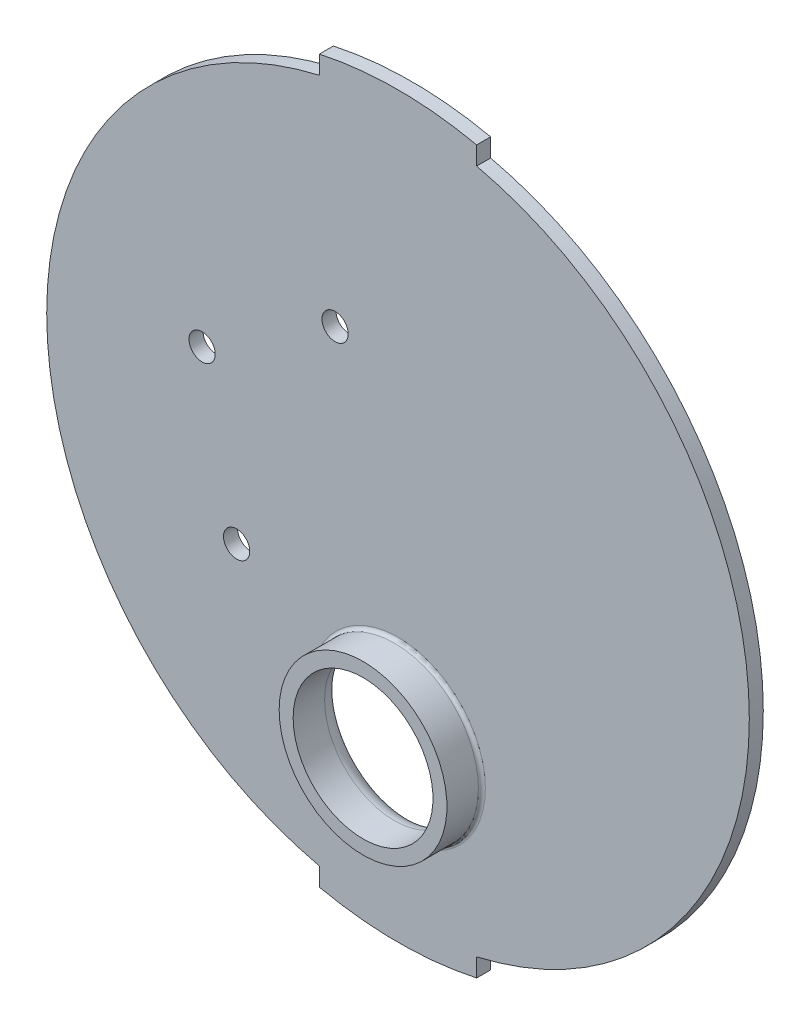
ISO-10303-21;
HEADER;
FILE_DESCRIPTION(('STEP AP214'),'2;1');
FILE_NAME('part.step','',(''),(''),'','','');
FILE_SCHEMA(('AUTOMOTIVE_DESIGN { 1 0 10303 214 1 1 1 1 }'));
ENDSEC;
DATA;
#1=APPLICATION_CONTEXT('core data for automotive mechanical design processes');
#2=APPLICATION_PROTOCOL_DEFINITION('international standard','automotive_design',2000,#1);
#3=PRODUCT_CONTEXT('',#1,'mechanical');
#4=PRODUCT('Part','Part','',(#3));
#5=PRODUCT_RELATED_PRODUCT_CATEGORY('part','',(#4));
#6=PRODUCT_DEFINITION_FORMATION('','',#4);
#7=PRODUCT_DEFINITION_CONTEXT('part definition',#1,'design');
#8=PRODUCT_DEFINITION('design','',#6,#7);
#9=PRODUCT_DEFINITION_SHAPE('','',#8);
#10=(LENGTH_UNIT() NAMED_UNIT(*) SI_UNIT(.MILLI.,.METRE.));
#11=(NAMED_UNIT(*) PLANE_ANGLE_UNIT() SI_UNIT($,.RADIAN.));
#12=(NAMED_UNIT(*) SI_UNIT($,.STERADIAN.) SOLID_ANGLE_UNIT());
#13=UNCERTAINTY_MEASURE_WITH_UNIT(LENGTH_MEASURE(1.E-05),#10,'distance_accuracy_value','');
#14=(GEOMETRIC_REPRESENTATION_CONTEXT(3) GLOBAL_UNCERTAINTY_ASSIGNED_CONTEXT((#13)) GLOBAL_UNIT_ASSIGNED_CONTEXT((#10,
#11,#12)) REPRESENTATION_CONTEXT('',''));
#15=CARTESIAN_POINT('',(0.,0.,0.));
#16=DIRECTION('',(0.,0.,1.));
#17=DIRECTION('',(1.,0.,0.));
#18=AXIS2_PLACEMENT_3D('',#15,#16,#17);
#19=CARTESIAN_POINT('',(4.36835391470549E-13,11.,0.8));
#20=DIRECTION('',(0.,0.,-1.));
#21=DIRECTION('',(-1.,0.,0.));
#22=AXIS2_PLACEMENT_3D('',#19,#20,#21);
#23=CYLINDRICAL_SURFACE('',#22,20.1);
#24=CARTESIAN_POINT('',(4.36835391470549E-13,11.,0.8));
#25=DIRECTION('',(0.,0.,1.));
#26=DIRECTION('',(1.,0.,0.));
#27=AXIS2_PLACEMENT_3D('',#24,#25,#26);
#28=CIRCLE('',#27,20.1);
#29=CARTESIAN_POINT('',(4.50000000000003,-8.5897932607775,0.8));
#30=VERTEX_POINT('',#29);
#31=CARTESIAN_POINT('',(4.50000000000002,30.5897932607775,0.8));
#32=VERTEX_POINT('',#31);
#33=EDGE_CURVE('E48',#30,#32,#28,.T.);
#34=ORIENTED_EDGE('',*,*,#33,.F.);
#35=DIRECTION('',(0.,0.,1.));
#36=VECTOR('',#35,1.);
#37=CARTESIAN_POINT('',(4.50000000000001,-8.58979326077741,-9.12999779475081));
#38=LINE('',#37,#36);
#39=CARTESIAN_POINT('',(4.50000000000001,-8.58979326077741,0.));
#40=VERTEX_POINT('',#39);
#41=EDGE_CURVE('E129',#40,#30,#38,.T.);
#42=ORIENTED_EDGE('',*,*,#41,.F.);
#43=CARTESIAN_POINT('',(4.36835391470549E-13,11.,0.));
#44=DIRECTION('',(0.,0.,1.));
#45=DIRECTION('',(1.,0.,0.));
#46=AXIS2_PLACEMENT_3D('',#43,#44,#45);
#47=CIRCLE('',#46,20.1);
#48=CARTESIAN_POINT('',(4.5,30.5897932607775,0.));
#49=VERTEX_POINT('',#48);
#50=EDGE_CURVE('E169',#40,#49,#47,.T.);
#51=ORIENTED_EDGE('',*,*,#50,.T.);
#52=DIRECTION('',(0.,0.,1.));
#53=VECTOR('',#52,1.);
#54=CARTESIAN_POINT('',(4.5,30.5897932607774,-9.12999779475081));
#55=LINE('',#54,#53);
#56=EDGE_CURVE('E152',#49,#32,#55,.T.);
#57=ORIENTED_EDGE('',*,*,#56,.T.);
#58=EDGE_LOOP('',(#34,#42,#51,#57));
#59=FACE_BOUND('',#58,.T.);
#60=ADVANCED_FACE('F33',(#59),#23,.T.);
#61=CARTESIAN_POINT('',(4.36835391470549E-13,11.,0.8));
#62=DIRECTION('',(0.,0.,1.));
#63=DIRECTION('',(1.,0.,0.));
#64=AXIS2_PLACEMENT_3D('',#61,#62,#63);
#65=PLANE('',#64);
#66=CARTESIAN_POINT('',(0.,0.,0.8));
#67=DIRECTION('',(0.,0.,1.));
#68=DIRECTION('',(1.,0.,0.));
#69=AXIS2_PLACEMENT_3D('',#66,#67,#68);
#70=CIRCLE('',#69,5.);
#71=CARTESIAN_POINT('',(5.,0.,0.8));
#72=VERTEX_POINT('',#71);
#73=EDGE_CURVE('E11',#72,#72,#70,.F.);
#74=ORIENTED_EDGE('',*,*,#73,.T.);
#75=EDGE_LOOP('',(#74));
#76=FACE_BOUND('',#75,.T.);
#77=CARTESIAN_POINT('',(-3.6,18.5894663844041,0.8));
#78=DIRECTION('',(0.,0.,1.));
#79=DIRECTION('',(1.,0.,0.));
#80=AXIS2_PLACEMENT_3D('',#77,#78,#79);
#81=CIRCLE('',#80,0.750000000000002);
#82=CARTESIAN_POINT('',(-2.85,18.5894663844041,0.8));
#83=VERTEX_POINT('',#82);
#84=EDGE_CURVE('E170',#83,#83,#81,.T.);
#85=ORIENTED_EDGE('',*,*,#84,.F.);
#86=EDGE_LOOP('',(#85));
#87=FACE_BOUND('',#86,.T.);
#88=CARTESIAN_POINT('',(-11.20763062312,13.7807288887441,0.8));
#89=DIRECTION('',(0.,0.,1.));
#90=DIRECTION('',(1.,0.,0.));
#91=AXIS2_PLACEMENT_3D('',#88,#89,#90);
#92=CIRCLE('',#91,0.749999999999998);
#93=CARTESIAN_POINT('',(-10.45763062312,13.7807288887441,0.8));
#94=VERTEX_POINT('',#93);
#95=EDGE_CURVE('E176',#94,#94,#92,.T.);
#96=ORIENTED_EDGE('',*,*,#95,.F.);
#97=EDGE_LOOP('',(#96));
#98=FACE_BOUND('',#97,.T.);
#99=CARTESIAN_POINT('',(-9.23309265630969,5.,0.8));
#100=DIRECTION('',(0.,0.,1.));
#101=DIRECTION('',(1.,0.,0.));
#102=AXIS2_PLACEMENT_3D('',#99,#100,#101);
#103=CIRCLE('',#102,0.750000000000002);
#104=CARTESIAN_POINT('',(-8.48309265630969,5.,0.8));
#105=VERTEX_POINT('',#104);
#106=EDGE_CURVE('E165',#105,#105,#103,.T.);
#107=ORIENTED_EDGE('',*,*,#106,.F.);
#108=EDGE_LOOP('',(#107));
#109=FACE_BOUND('',#108,.T.);
#110=CARTESIAN_POINT('',(-4.5,30.5897932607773,0.8));
#111=VERTEX_POINT('',#110);
#112=CARTESIAN_POINT('',(-4.49999999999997,-8.58979326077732,0.8));
#113=VERTEX_POINT('',#112);
#114=EDGE_CURVE('E122',#111,#113,#28,.T.);
#115=ORIENTED_EDGE('',*,*,#114,.T.);
#116=DIRECTION('',(0.,-1.,0.));
#117=VECTOR('',#116,1.);
#118=CARTESIAN_POINT('',(-4.5,-8.58979326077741,0.8));
#119=LINE('',#118,#117);
#120=CARTESIAN_POINT('',(-4.49999999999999,-9.64014595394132,0.8));
#121=VERTEX_POINT('',#120);
#122=EDGE_CURVE('E104',#113,#121,#119,.T.);
#123=ORIENTED_EDGE('',*,*,#122,.T.);
#124=CARTESIAN_POINT('',(0.,11.,0.8));
#125=DIRECTION('',(0.,0.,1.));
#126=DIRECTION('',(1.,0.,0.));
#127=AXIS2_PLACEMENT_3D('',#124,#125,#126);
#128=CIRCLE('',#127,21.125);
#129=CARTESIAN_POINT('',(4.5,-9.64014595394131,0.8));
#130=VERTEX_POINT('',#129);
#131=EDGE_CURVE('E112',#121,#130,#128,.T.);
#132=ORIENTED_EDGE('',*,*,#131,.T.);
#133=DIRECTION('',(0.,1.,0.));
#134=VECTOR('',#133,1.);
#135=CARTESIAN_POINT('',(4.50000000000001,-8.58979326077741,0.8));
#136=LINE('',#135,#134);
#137=EDGE_CURVE('E118',#130,#30,#136,.T.);
#138=ORIENTED_EDGE('',*,*,#137,.T.);
#139=ORIENTED_EDGE('',*,*,#33,.T.);
#140=DIRECTION('',(0.,1.,0.));
#141=VECTOR('',#140,1.);
#142=CARTESIAN_POINT('',(4.5,31.6401459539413,0.8));
#143=LINE('',#142,#141);
#144=CARTESIAN_POINT('',(4.5,31.6401459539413,0.8));
#145=VERTEX_POINT('',#144);
#146=EDGE_CURVE('E147',#32,#145,#143,.T.);
#147=ORIENTED_EDGE('',*,*,#146,.T.);
#148=CARTESIAN_POINT('',(0.,11.,0.8));
#149=DIRECTION('',(0.,0.,1.));
#150=DIRECTION('',(1.,0.,0.));
#151=AXIS2_PLACEMENT_3D('',#148,#149,#150);
#152=CIRCLE('',#151,21.125);
#153=CARTESIAN_POINT('',(-4.5,31.6401459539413,0.8));
#154=VERTEX_POINT('',#153);
#155=EDGE_CURVE('E135',#145,#154,#152,.T.);
#156=ORIENTED_EDGE('',*,*,#155,.T.);
#157=DIRECTION('',(0.,-1.,0.));
#158=VECTOR('',#157,1.);
#159=CARTESIAN_POINT('',(-4.5,30.5897932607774,0.8));
#160=LINE('',#159,#158);
#161=EDGE_CURVE('E145',#154,#111,#160,.T.);
#162=ORIENTED_EDGE('',*,*,#161,.T.);
#163=EDGE_LOOP('',(#115,#123,#132,#138,#139,#147,#156,#162));
#164=FACE_BOUND('',#163,.T.);
#165=ADVANCED_FACE('F120',(#76,#87,#98,#109,#164),#65,.T.);
#166=CARTESIAN_POINT('',(4.36835391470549E-13,11.,0.));
#167=DIRECTION('',(0.,0.,1.));
#168=DIRECTION('',(1.,0.,0.));
#169=AXIS2_PLACEMENT_3D('',#166,#167,#168);
#170=PLANE('',#169);
#171=CARTESIAN_POINT('',(0.,0.,0.));
#172=DIRECTION('',(0.,0.,1.));
#173=DIRECTION('',(1.,0.,0.));
#174=AXIS2_PLACEMENT_3D('',#171,#172,#173);
#175=CIRCLE('',#174,5.);
#176=CARTESIAN_POINT('',(5.,0.,0.));
#177=VERTEX_POINT('',#176);
#178=EDGE_CURVE('E185',#177,#177,#175,.T.);
#179=ORIENTED_EDGE('',*,*,#178,.T.);
#180=EDGE_LOOP('',(#179));
#181=FACE_BOUND('',#180,.T.);
#182=CARTESIAN_POINT('',(-3.6,18.5894663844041,0.));
#183=DIRECTION('',(0.,0.,1.));
#184=DIRECTION('',(1.,0.,0.));
#185=AXIS2_PLACEMENT_3D('',#182,#183,#184);
#186=CIRCLE('',#185,0.750000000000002);
#187=CARTESIAN_POINT('',(-2.85,18.5894663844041,0.));
#188=VERTEX_POINT('',#187);
#189=EDGE_CURVE('E166',#188,#188,#186,.T.);
#190=ORIENTED_EDGE('',*,*,#189,.T.);
#191=EDGE_LOOP('',(#190));
#192=FACE_BOUND('',#191,.T.);
#193=CARTESIAN_POINT('',(-11.20763062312,13.7807288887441,0.));
#194=DIRECTION('',(0.,0.,1.));
#195=DIRECTION('',(1.,0.,0.));
#196=AXIS2_PLACEMENT_3D('',#193,#194,#195);
#197=CIRCLE('',#196,0.749999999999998);
#198=CARTESIAN_POINT('',(-10.45763062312,13.7807288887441,0.));
#199=VERTEX_POINT('',#198);
#200=EDGE_CURVE('E173',#199,#199,#197,.T.);
#201=ORIENTED_EDGE('',*,*,#200,.T.);
#202=EDGE_LOOP('',(#201));
#203=FACE_BOUND('',#202,.T.);
#204=CARTESIAN_POINT('',(-9.23309265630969,5.,0.));
#205=DIRECTION('',(0.,0.,1.));
#206=DIRECTION('',(1.,0.,0.));
#207=AXIS2_PLACEMENT_3D('',#204,#205,#206);
#208=CIRCLE('',#207,0.750000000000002);
#209=CARTESIAN_POINT('',(-8.48309265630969,5.,0.));
#210=VERTEX_POINT('',#209);
#211=EDGE_CURVE('E179',#210,#210,#208,.T.);
#212=ORIENTED_EDGE('',*,*,#211,.T.);
#213=EDGE_LOOP('',(#212));
#214=FACE_BOUND('',#213,.T.);
#215=CARTESIAN_POINT('',(-4.49999999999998,30.5897932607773,0.));
#216=VERTEX_POINT('',#215);
#217=CARTESIAN_POINT('',(-4.49999999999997,-8.58979326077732,0.));
#218=VERTEX_POINT('',#217);
#219=EDGE_CURVE('E186',#216,#218,#47,.T.);
#220=ORIENTED_EDGE('',*,*,#219,.F.);
#221=DIRECTION('',(0.,1.,0.));
#222=VECTOR('',#221,1.);
#223=CARTESIAN_POINT('',(-4.5,30.5897932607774,0.));
#224=LINE('',#223,#222);
#225=CARTESIAN_POINT('',(-4.5,31.6401459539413,0.));
#226=VERTEX_POINT('',#225);
#227=EDGE_CURVE('E142',#216,#226,#224,.T.);
#228=ORIENTED_EDGE('',*,*,#227,.T.);
#229=CARTESIAN_POINT('',(0.,11.,0.));
#230=DIRECTION('',(0.,0.,1.));
#231=DIRECTION('',(1.,0.,0.));
#232=AXIS2_PLACEMENT_3D('',#229,#230,#231);
#233=CIRCLE('',#232,21.125);
#234=CARTESIAN_POINT('',(4.5,31.6401459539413,0.));
#235=VERTEX_POINT('',#234);
#236=EDGE_CURVE('E139',#226,#235,#233,.F.);
#237=ORIENTED_EDGE('',*,*,#236,.T.);
#238=DIRECTION('',(0.,-1.,0.));
#239=VECTOR('',#238,1.);
#240=CARTESIAN_POINT('',(4.5,31.6401459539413,0.));
#241=LINE('',#240,#239);
#242=EDGE_CURVE('E136',#235,#49,#241,.T.);
#243=ORIENTED_EDGE('',*,*,#242,.T.);
#244=ORIENTED_EDGE('',*,*,#50,.F.);
#245=DIRECTION('',(0.,-1.,0.));
#246=VECTOR('',#245,1.);
#247=CARTESIAN_POINT('',(4.50000000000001,-8.58979326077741,0.));
#248=LINE('',#247,#246);
#249=CARTESIAN_POINT('',(4.5,-9.64014595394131,0.));
#250=VERTEX_POINT('',#249);
#251=EDGE_CURVE('E125',#40,#250,#248,.T.);
#252=ORIENTED_EDGE('',*,*,#251,.T.);
#253=CARTESIAN_POINT('',(0.,11.,0.));
#254=DIRECTION('',(0.,0.,1.));
#255=DIRECTION('',(1.,0.,0.));
#256=AXIS2_PLACEMENT_3D('',#253,#254,#255);
#257=CIRCLE('',#256,21.125);
#258=CARTESIAN_POINT('',(-4.49999999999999,-9.64014595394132,0.));
#259=VERTEX_POINT('',#258);
#260=EDGE_CURVE('E131',#250,#259,#257,.F.);
#261=ORIENTED_EDGE('',*,*,#260,.T.);
#262=DIRECTION('',(0.,1.,0.));
#263=VECTOR('',#262,1.);
#264=CARTESIAN_POINT('',(-4.5,-8.58979326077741,0.));
#265=LINE('',#264,#263);
#266=EDGE_CURVE('E106',#259,#218,#265,.T.);
#267=ORIENTED_EDGE('',*,*,#266,.T.);
#268=EDGE_LOOP('',(#220,#228,#237,#243,#244,#252,#261,#267));
#269=FACE_BOUND('',#268,.T.);
#270=ADVANCED_FACE('F218',(#181,#192,#203,#214,#269),#170,.F.);
#271=ORIENTED_EDGE('',*,*,#219,.T.);
#272=DIRECTION('',(0.,0.,1.));
#273=VECTOR('',#272,1.);
#274=CARTESIAN_POINT('',(-4.5,-8.58979326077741,-9.12999779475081));
#275=LINE('',#274,#273);
#276=EDGE_CURVE('E56',#218,#113,#275,.T.);
#277=ORIENTED_EDGE('',*,*,#276,.T.);
#278=ORIENTED_EDGE('',*,*,#114,.F.);
#279=DIRECTION('',(0.,0.,1.));
#280=VECTOR('',#279,1.);
#281=CARTESIAN_POINT('',(-4.49999999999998,30.5897932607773,-9.12999779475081));
#282=LINE('',#281,#280);
#283=EDGE_CURVE('E154',#216,#111,#282,.T.);
#284=ORIENTED_EDGE('',*,*,#283,.F.);
#285=EDGE_LOOP('',(#271,#277,#278,#284));
#286=FACE_BOUND('',#285,.T.);
#287=ADVANCED_FACE('F214',(#286),#23,.T.);
#288=CARTESIAN_POINT('',(0.,0.,0.8));
#289=DIRECTION('',(0.,0.,-1.));
#290=DIRECTION('',(-1.,0.,0.));
#291=AXIS2_PLACEMENT_3D('',#288,#289,#290);
#292=CYLINDRICAL_SURFACE('',#291,4.);
#293=CARTESIAN_POINT('',(0.,0.,1.));
#294=DIRECTION('',(0.,0.,1.));
#295=DIRECTION('',(1.,0.,0.));
#296=AXIS2_PLACEMENT_3D('',#293,#294,#295);
#297=CIRCLE('',#296,4.);
#298=CARTESIAN_POINT('',(4.,0.,1.));
#299=VERTEX_POINT('',#298);
#300=EDGE_CURVE('E190',#299,#299,#297,.F.);
#301=ORIENTED_EDGE('',*,*,#300,.T.);
#302=EDGE_LOOP('',(#301));
#303=FACE_BOUND('',#302,.T.);
#304=CARTESIAN_POINT('',(0.,0.,2.8));
#305=DIRECTION('',(0.,0.,-1.));
#306=DIRECTION('',(-1.,0.,0.));
#307=AXIS2_PLACEMENT_3D('',#304,#305,#306);
#308=CIRCLE('',#307,4.);
#309=CARTESIAN_POINT('',(-4.00000000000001,0.,2.8));
#310=VERTEX_POINT('',#309);
#311=EDGE_CURVE('E159',#310,#310,#308,.T.);
#312=ORIENTED_EDGE('',*,*,#311,.F.);
#313=EDGE_LOOP('',(#312));
#314=FACE_BOUND('',#313,.T.);
#315=ADVANCED_FACE('F223',(#303,#314),#292,.F.);
#316=CARTESIAN_POINT('',(-9.23309265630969,5.,0.));
#317=DIRECTION('',(0.,0.,1.));
#318=DIRECTION('',(1.,0.,0.));
#319=AXIS2_PLACEMENT_3D('',#316,#317,#318);
#320=CYLINDRICAL_SURFACE('',#319,0.750000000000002);
#321=ORIENTED_EDGE('',*,*,#211,.F.);
#322=EDGE_LOOP('',(#321));
#323=FACE_BOUND('',#322,.T.);
#324=ORIENTED_EDGE('',*,*,#106,.T.);
#325=EDGE_LOOP('',(#324));
#326=FACE_BOUND('',#325,.T.);
#327=ADVANCED_FACE('F228',(#323,#326),#320,.F.);
#328=CARTESIAN_POINT('',(-11.20763062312,13.7807288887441,0.));
#329=DIRECTION('',(0.,0.,1.));
#330=DIRECTION('',(1.,0.,0.));
#331=AXIS2_PLACEMENT_3D('',#328,#329,#330);
#332=CYLINDRICAL_SURFACE('',#331,0.749999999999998);
#333=ORIENTED_EDGE('',*,*,#200,.F.);
#334=EDGE_LOOP('',(#333));
#335=FACE_BOUND('',#334,.T.);
#336=ORIENTED_EDGE('',*,*,#95,.T.);
#337=EDGE_LOOP('',(#336));
#338=FACE_BOUND('',#337,.T.);
#339=ADVANCED_FACE('F267',(#335,#338),#332,.F.);
#340=CARTESIAN_POINT('',(-3.6,18.5894663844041,0.));
#341=DIRECTION('',(0.,0.,1.));
#342=DIRECTION('',(1.,0.,0.));
#343=AXIS2_PLACEMENT_3D('',#340,#341,#342);
#344=CYLINDRICAL_SURFACE('',#343,0.750000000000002);
#345=ORIENTED_EDGE('',*,*,#189,.F.);
#346=EDGE_LOOP('',(#345));
#347=FACE_BOUND('',#346,.T.);
#348=ORIENTED_EDGE('',*,*,#84,.T.);
#349=EDGE_LOOP('',(#348));
#350=FACE_BOUND('',#349,.T.);
#351=ADVANCED_FACE('F264',(#347,#350),#344,.F.);
#352=CARTESIAN_POINT('',(0.,0.,2.8));
#353=DIRECTION('',(0.,0.,-1.));
#354=DIRECTION('',(-1.,0.,0.));
#355=AXIS2_PLACEMENT_3D('',#352,#353,#354);
#356=CYLINDRICAL_SURFACE('',#355,4.8);
#357=CARTESIAN_POINT('',(0.,0.,1.));
#358=DIRECTION('',(0.,0.,1.));
#359=DIRECTION('',(1.,0.,0.));
#360=AXIS2_PLACEMENT_3D('',#357,#358,#359);
#361=CIRCLE('',#360,4.8);
#362=CARTESIAN_POINT('',(4.8,0.,1.));
#363=VERTEX_POINT('',#362);
#364=EDGE_CURVE('E41',#363,#363,#361,.T.);
#365=ORIENTED_EDGE('',*,*,#364,.T.);
#366=EDGE_LOOP('',(#365));
#367=FACE_BOUND('',#366,.T.);
#368=CARTESIAN_POINT('',(0.,0.,2.8));
#369=DIRECTION('',(0.,0.,-1.));
#370=DIRECTION('',(-1.,0.,0.));
#371=AXIS2_PLACEMENT_3D('',#368,#369,#370);
#372=CIRCLE('',#371,4.8);
#373=CARTESIAN_POINT('',(-4.80000000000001,0.,2.8));
#374=VERTEX_POINT('',#373);
#375=EDGE_CURVE('E162',#374,#374,#372,.T.);
#376=ORIENTED_EDGE('',*,*,#375,.T.);
#377=EDGE_LOOP('',(#376));
#378=FACE_BOUND('',#377,.T.);
#379=ADVANCED_FACE('F195',(#367,#378),#356,.T.);
#380=CARTESIAN_POINT('',(0.,0.,2.8));
#381=DIRECTION('',(0.,0.,-1.));
#382=DIRECTION('',(-1.,0.,0.));
#383=AXIS2_PLACEMENT_3D('',#380,#381,#382);
#384=PLANE('',#383);
#385=ORIENTED_EDGE('',*,*,#311,.T.);
#386=EDGE_LOOP('',(#385));
#387=FACE_BOUND('',#386,.T.);
#388=ORIENTED_EDGE('',*,*,#375,.F.);
#389=EDGE_LOOP('',(#388));
#390=FACE_BOUND('',#389,.T.);
#391=ADVANCED_FACE('F209',(#387,#390),#384,.F.);
#392=CARTESIAN_POINT('',(0.,0.,1.));
#393=DIRECTION('',(0.,0.,1.));
#394=DIRECTION('',(1.,0.,0.));
#395=AXIS2_PLACEMENT_3D('',#392,#393,#394);
#396=TOROIDAL_SURFACE('',#395,5.,1.);
#397=ORIENTED_EDGE('',*,*,#300,.F.);
#398=EDGE_LOOP('',(#397));
#399=FACE_BOUND('',#398,.T.);
#400=ORIENTED_EDGE('',*,*,#178,.F.);
#401=EDGE_LOOP('',(#400));
#402=FACE_BOUND('',#401,.T.);
#403=ADVANCED_FACE('F200',(#399,#402),#396,.T.);
#404=CARTESIAN_POINT('',(0.,0.,1.));
#405=DIRECTION('',(0.,0.,1.));
#406=DIRECTION('',(1.,0.,0.));
#407=AXIS2_PLACEMENT_3D('',#404,#405,#406);
#408=TOROIDAL_SURFACE('',#407,5.,0.2);
#409=ORIENTED_EDGE('',*,*,#73,.F.);
#410=EDGE_LOOP('',(#409));
#411=FACE_BOUND('',#410,.T.);
#412=ORIENTED_EDGE('',*,*,#364,.F.);
#413=EDGE_LOOP('',(#412));
#414=FACE_BOUND('',#413,.T.);
#415=ADVANCED_FACE('F35',(#411,#414),#408,.F.);
#416=CARTESIAN_POINT('',(0.,11.,-9.12999779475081));
#417=DIRECTION('',(0.,0.,1.));
#418=DIRECTION('',(1.,0.,0.));
#419=AXIS2_PLACEMENT_3D('',#416,#417,#418);
#420=CYLINDRICAL_SURFACE('',#419,21.125);
#421=ORIENTED_EDGE('',*,*,#236,.F.);
#422=DIRECTION('',(0.,0.,1.));
#423=VECTOR('',#422,1.);
#424=CARTESIAN_POINT('',(-4.5,31.6401459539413,-9.12999779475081));
#425=LINE('',#424,#423);
#426=EDGE_CURVE('E150',#226,#154,#425,.T.);
#427=ORIENTED_EDGE('',*,*,#426,.T.);
#428=ORIENTED_EDGE('',*,*,#155,.F.);
#429=DIRECTION('',(0.,0.,1.));
#430=VECTOR('',#429,1.);
#431=CARTESIAN_POINT('',(4.5,31.6401459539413,-9.12999779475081));
#432=LINE('',#431,#430);
#433=EDGE_CURVE('E140',#235,#145,#432,.T.);
#434=ORIENTED_EDGE('',*,*,#433,.F.);
#435=EDGE_LOOP('',(#421,#427,#428,#434));
#436=FACE_BOUND('',#435,.T.);
#437=ADVANCED_FACE('F199',(#436),#420,.T.);
#438=CARTESIAN_POINT('',(4.5,31.6401459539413,-9.12999779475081));
#439=DIRECTION('',(1.,0.,0.));
#440=DIRECTION('',(0.,1.,0.));
#441=AXIS2_PLACEMENT_3D('',#438,#439,#440);
#442=PLANE('',#441);
#443=ORIENTED_EDGE('',*,*,#242,.F.);
#444=ORIENTED_EDGE('',*,*,#433,.T.);
#445=ORIENTED_EDGE('',*,*,#146,.F.);
#446=ORIENTED_EDGE('',*,*,#56,.F.);
#447=EDGE_LOOP('',(#443,#444,#445,#446));
#448=FACE_BOUND('',#447,.T.);
#449=ADVANCED_FACE('F206',(#448),#442,.T.);
#450=CARTESIAN_POINT('',(-4.5,30.5897932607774,-9.12999779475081));
#451=DIRECTION('',(-1.,0.,0.));
#452=DIRECTION('',(0.,-1.,0.));
#453=AXIS2_PLACEMENT_3D('',#450,#451,#452);
#454=PLANE('',#453);
#455=ORIENTED_EDGE('',*,*,#227,.F.);
#456=ORIENTED_EDGE('',*,*,#283,.T.);
#457=ORIENTED_EDGE('',*,*,#161,.F.);
#458=ORIENTED_EDGE('',*,*,#426,.F.);
#459=EDGE_LOOP('',(#455,#456,#457,#458));
#460=FACE_BOUND('',#459,.T.);
#461=ADVANCED_FACE('F248',(#460),#454,.T.);
#462=CARTESIAN_POINT('',(4.50000000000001,-8.58979326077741,-9.12999779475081));
#463=DIRECTION('',(1.,0.,0.));
#464=DIRECTION('',(0.,1.,0.));
#465=AXIS2_PLACEMENT_3D('',#462,#463,#464);
#466=PLANE('',#465);
#467=ORIENTED_EDGE('',*,*,#251,.F.);
#468=ORIENTED_EDGE('',*,*,#41,.T.);
#469=ORIENTED_EDGE('',*,*,#137,.F.);
#470=DIRECTION('',(0.,0.,1.));
#471=VECTOR('',#470,1.);
#472=CARTESIAN_POINT('',(4.5,-9.64014595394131,-9.12999779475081));
#473=LINE('',#472,#471);
#474=EDGE_CURVE('E109',#250,#130,#473,.T.);
#475=ORIENTED_EDGE('',*,*,#474,.F.);
#476=EDGE_LOOP('',(#467,#468,#469,#475));
#477=FACE_BOUND('',#476,.T.);
#478=ADVANCED_FACE('F237',(#477),#466,.T.);
#479=CARTESIAN_POINT('',(0.,11.,-9.12999779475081));
#480=DIRECTION('',(0.,0.,1.));
#481=DIRECTION('',(1.,0.,0.));
#482=AXIS2_PLACEMENT_3D('',#479,#480,#481);
#483=CYLINDRICAL_SURFACE('',#482,21.125);
#484=ORIENTED_EDGE('',*,*,#260,.F.);
#485=ORIENTED_EDGE('',*,*,#474,.T.);
#486=ORIENTED_EDGE('',*,*,#131,.F.);
#487=DIRECTION('',(0.,0.,1.));
#488=VECTOR('',#487,1.);
#489=CARTESIAN_POINT('',(-4.49999999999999,-9.64014595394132,-9.12999779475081));
#490=LINE('',#489,#488);
#491=EDGE_CURVE('E100',#259,#121,#490,.T.);
#492=ORIENTED_EDGE('',*,*,#491,.F.);
#493=EDGE_LOOP('',(#484,#485,#486,#492));
#494=FACE_BOUND('',#493,.T.);
#495=ADVANCED_FACE('F113',(#494),#483,.T.);
#496=CARTESIAN_POINT('',(-4.5,-8.58979326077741,-9.12999779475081));
#497=DIRECTION('',(-1.,0.,0.));
#498=DIRECTION('',(0.,-1.,0.));
#499=AXIS2_PLACEMENT_3D('',#496,#497,#498);
#500=PLANE('',#499);
#501=ORIENTED_EDGE('',*,*,#266,.F.);
#502=ORIENTED_EDGE('',*,*,#491,.T.);
#503=ORIENTED_EDGE('',*,*,#122,.F.);
#504=ORIENTED_EDGE('',*,*,#276,.F.);
#505=EDGE_LOOP('',(#501,#502,#503,#504));
#506=FACE_BOUND('',#505,.T.);
#507=ADVANCED_FACE('F102',(#506),#500,.T.);
#508=CLOSED_SHELL('',(#60,#165,#270,#287,#315,#327,#339,#351,#379,#391,#403,#415,#437,#449,#461,
#478,#495,#507));
#509=MANIFOLD_SOLID_BREP('B2',#508);
#510=ADVANCED_BREP_SHAPE_REPRESENTATION('',(#18,#509),#14);
#511=SHAPE_DEFINITION_REPRESENTATION(#9,#510);
ENDSEC;
END-ISO-10303-21;
